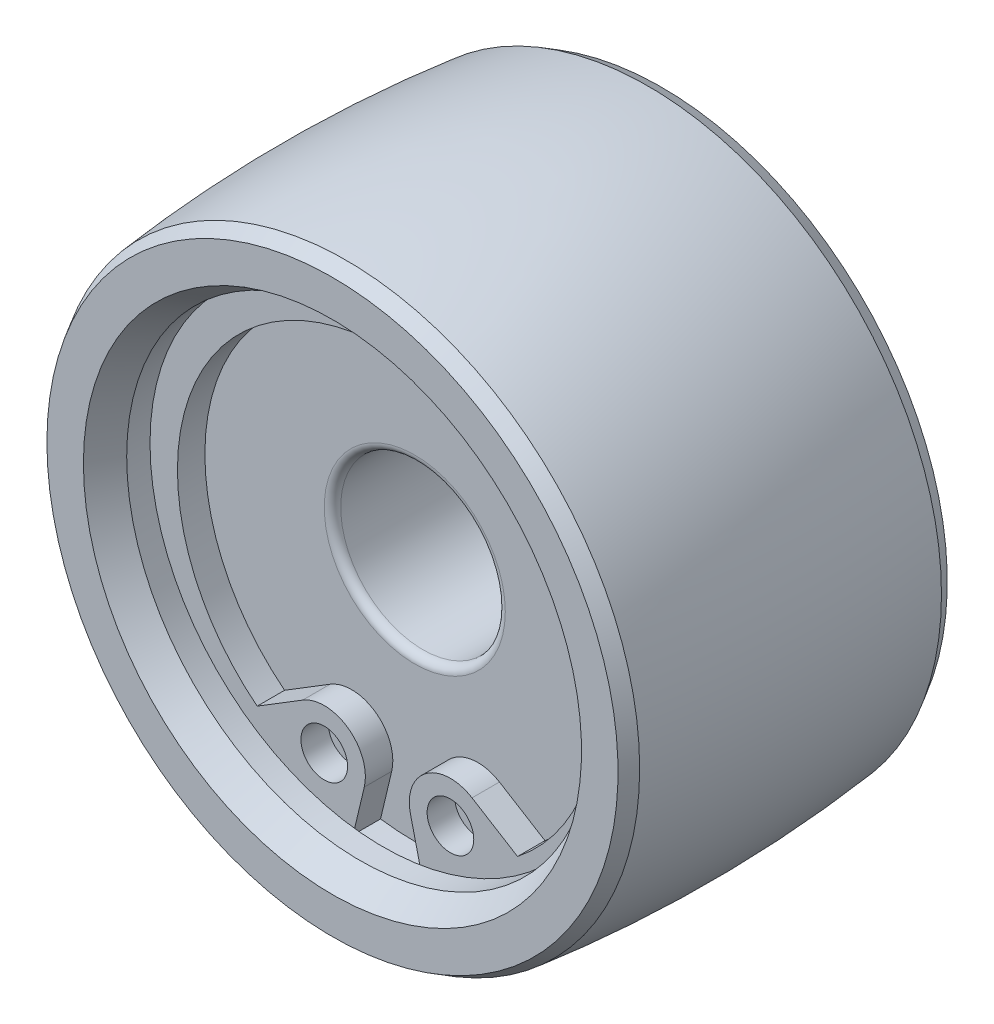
ISO-10303-21;
HEADER;
FILE_DESCRIPTION(('STEP AP214'),'2;1');
FILE_NAME('part.step','',(''),(''),'','','');
FILE_SCHEMA(('AUTOMOTIVE_DESIGN { 1 0 10303 214 1 1 1 1 }'));
ENDSEC;
DATA;
#1=APPLICATION_CONTEXT('core data for automotive mechanical design processes');
#2=APPLICATION_PROTOCOL_DEFINITION('international standard','automotive_design',2000,#1);
#3=PRODUCT_CONTEXT('',#1,'mechanical');
#4=PRODUCT('Part','Part','',(#3));
#5=PRODUCT_RELATED_PRODUCT_CATEGORY('part','',(#4));
#6=PRODUCT_DEFINITION_FORMATION('','',#4);
#7=PRODUCT_DEFINITION_CONTEXT('part definition',#1,'design');
#8=PRODUCT_DEFINITION('design','',#6,#7);
#9=PRODUCT_DEFINITION_SHAPE('','',#8);
#10=(LENGTH_UNIT() NAMED_UNIT(*) SI_UNIT(.MILLI.,.METRE.));
#11=(NAMED_UNIT(*) PLANE_ANGLE_UNIT() SI_UNIT($,.RADIAN.));
#12=(NAMED_UNIT(*) SI_UNIT($,.STERADIAN.) SOLID_ANGLE_UNIT());
#13=UNCERTAINTY_MEASURE_WITH_UNIT(LENGTH_MEASURE(1.E-05),#10,'distance_accuracy_value','');
#14=(GEOMETRIC_REPRESENTATION_CONTEXT(3) GLOBAL_UNCERTAINTY_ASSIGNED_CONTEXT((#13)) GLOBAL_UNIT_ASSIGNED_CONTEXT((#10,
#11,#12)) REPRESENTATION_CONTEXT('',''));
#15=CARTESIAN_POINT('',(0.,0.,0.));
#16=DIRECTION('',(0.,0.,1.));
#17=DIRECTION('',(1.,0.,0.));
#18=AXIS2_PLACEMENT_3D('',#15,#16,#17);
#19=CARTESIAN_POINT('',(0.,0.,-4.99999999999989));
#20=DIRECTION('',(0.,0.,1.));
#21=DIRECTION('',(1.,0.,0.));
#22=AXIS2_PLACEMENT_3D('',#19,#20,#21);
#23=CONICAL_SURFACE('',#22,10.9852544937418,0.523598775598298);
#24=CARTESIAN_POINT('',(0.,0.,-5.99999999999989));
#25=DIRECTION('',(0.,0.,-1.));
#26=DIRECTION('',(-1.,0.,0.));
#27=AXIS2_PLACEMENT_3D('',#24,#25,#26);
#28=CIRCLE('',#27,10.4079042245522);
#29=CARTESIAN_POINT('',(-10.4079042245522,0.,-5.99999999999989));
#30=VERTEX_POINT('',#29);
#31=EDGE_CURVE('E270',#30,#30,#28,.T.);
#32=ORIENTED_EDGE('',*,*,#31,.F.);
#33=EDGE_LOOP('',(#32));
#34=FACE_BOUND('',#33,.T.);
#35=CARTESIAN_POINT('',(0.,0.,-5.49999999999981));
#36=DIRECTION('',(0.,0.,-1.));
#37=DIRECTION('',(-1.,0.,0.));
#38=AXIS2_PLACEMENT_3D('',#35,#36,#37);
#39=CIRCLE('',#38,10.6965793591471);
#40=CARTESIAN_POINT('',(-10.6965793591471,0.,-5.49999999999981));
#41=VERTEX_POINT('',#40);
#42=EDGE_CURVE('E273',#41,#41,#39,.F.);
#43=ORIENTED_EDGE('',*,*,#42,.F.);
#44=EDGE_LOOP('',(#43));
#45=FACE_BOUND('',#44,.T.);
#46=ADVANCED_FACE('F14',(#34,#45),#23,.T.);
#47=CARTESIAN_POINT('',(0.,0.,-6.));
#48=DIRECTION('',(0.,0.,1.));
#49=DIRECTION('',(1.,0.,0.));
#50=AXIS2_PLACEMENT_3D('',#47,#48,#49);
#51=PLANE('',#50);
#52=ORIENTED_EDGE('',*,*,#31,.T.);
#53=EDGE_LOOP('',(#52));
#54=FACE_BOUND('',#53,.T.);
#55=CARTESIAN_POINT('',(0.,0.,-6.));
#56=DIRECTION('',(0.,0.,-1.));
#57=DIRECTION('',(-1.,0.,0.));
#58=AXIS2_PLACEMENT_3D('',#55,#56,#57);
#59=CIRCLE('',#58,6.5);
#60=CARTESIAN_POINT('',(-6.5,0.,-6.));
#61=VERTEX_POINT('',#60);
#62=EDGE_CURVE('E171',#61,#61,#59,.T.);
#63=ORIENTED_EDGE('',*,*,#62,.F.);
#64=EDGE_LOOP('',(#63));
#65=FACE_BOUND('',#64,.T.);
#66=ADVANCED_FACE('F307',(#54,#65),#51,.F.);
#67=CARTESIAN_POINT('',(0.,0.,0.));
#68=DIRECTION('',(0.,0.,-1.));
#69=DIRECTION('',(-1.,0.,0.));
#70=AXIS2_PLACEMENT_3D('',#67,#68,#69);
#71=DEGENERATE_TOROIDAL_SURFACE('',#70,39.,50.,.F.);
#72=ORIENTED_EDGE('',*,*,#42,.T.);
#73=EDGE_LOOP('',(#72));
#74=FACE_BOUND('',#73,.T.);
#75=CARTESIAN_POINT('',(0.,0.,5.5));
#76=DIRECTION('',(0.,0.,1.));
#77=DIRECTION('',(1.,0.,0.));
#78=AXIS2_PLACEMENT_3D('',#75,#76,#77);
#79=CIRCLE('',#78,10.6965793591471);
#80=CARTESIAN_POINT('',(10.6965793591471,0.,5.5));
#81=VERTEX_POINT('',#80);
#82=EDGE_CURVE('E277',#81,#81,#79,.F.);
#83=ORIENTED_EDGE('',*,*,#82,.T.);
#84=EDGE_LOOP('',(#83));
#85=FACE_BOUND('',#84,.T.);
#86=ADVANCED_FACE('F303',(#74,#85),#71,.F.);
#87=CARTESIAN_POINT('',(0.,0.,-275.));
#88=DIRECTION('',(0.,0.,-1.));
#89=DIRECTION('',(-1.,0.,0.));
#90=AXIS2_PLACEMENT_3D('',#87,#88,#89);
#91=CYLINDRICAL_SURFACE('',#90,6.5);
#92=CARTESIAN_POINT('',(0.,0.,-3.));
#93=DIRECTION('',(0.,0.,-1.));
#94=DIRECTION('',(-1.,0.,0.));
#95=AXIS2_PLACEMENT_3D('',#92,#93,#94);
#96=CIRCLE('',#95,6.5);
#97=CARTESIAN_POINT('',(-6.5,0.,-3.));
#98=VERTEX_POINT('',#97);
#99=EDGE_CURVE('E295',#98,#98,#96,.T.);
#100=ORIENTED_EDGE('',*,*,#99,.F.);
#101=EDGE_LOOP('',(#100));
#102=FACE_BOUND('',#101,.T.);
#103=ORIENTED_EDGE('',*,*,#62,.T.);
#104=EDGE_LOOP('',(#103));
#105=FACE_BOUND('',#104,.T.);
#106=ADVANCED_FACE('F362',(#102,#105),#91,.F.);
#107=CARTESIAN_POINT('',(0.,0.,6.));
#108=DIRECTION('',(0.,0.,-1.));
#109=DIRECTION('',(-1.,0.,0.));
#110=AXIS2_PLACEMENT_3D('',#107,#108,#109);
#111=CONICAL_SURFACE('',#110,10.4079042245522,0.523598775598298);
#112=CARTESIAN_POINT('',(0.,0.,6.));
#113=DIRECTION('',(0.,0.,-1.));
#114=DIRECTION('',(-1.,0.,0.));
#115=AXIS2_PLACEMENT_3D('',#112,#113,#114);
#116=CIRCLE('',#115,10.4079042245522);
#117=CARTESIAN_POINT('',(-10.4079042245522,0.,6.));
#118=VERTEX_POINT('',#117);
#119=EDGE_CURVE('E274',#118,#118,#116,.T.);
#120=ORIENTED_EDGE('',*,*,#119,.T.);
#121=EDGE_LOOP('',(#120));
#122=FACE_BOUND('',#121,.T.);
#123=ORIENTED_EDGE('',*,*,#82,.F.);
#124=EDGE_LOOP('',(#123));
#125=FACE_BOUND('',#124,.T.);
#126=ADVANCED_FACE('F330',(#122,#125),#111,.T.);
#127=CARTESIAN_POINT('',(0.,3.9383186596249,-3.));
#128=DIRECTION('',(0.,0.,-1.));
#129=DIRECTION('',(-1.,0.,0.));
#130=AXIS2_PLACEMENT_3D('',#127,#128,#129);
#131=PLANE('',#130);
#132=CARTESIAN_POINT('',(0.,0.,-3.));
#133=DIRECTION('',(0.,0.,1.));
#134=DIRECTION('',(1.,0.,0.));
#135=AXIS2_PLACEMENT_3D('',#132,#133,#134);
#136=CIRCLE('',#135,3.3);
#137=CARTESIAN_POINT('',(3.3,0.,-3.));
#138=VERTEX_POINT('',#137);
#139=EDGE_CURVE('E261',#138,#138,#136,.T.);
#140=ORIENTED_EDGE('',*,*,#139,.T.);
#141=EDGE_LOOP('',(#140));
#142=FACE_BOUND('',#141,.T.);
#143=ORIENTED_EDGE('',*,*,#99,.T.);
#144=EDGE_LOOP('',(#143));
#145=FACE_BOUND('',#144,.T.);
#146=ADVANCED_FACE('F326',(#142,#145),#131,.T.);
#147=CARTESIAN_POINT('',(0.,0.,6.));
#148=DIRECTION('',(0.,0.,1.));
#149=DIRECTION('',(1.,0.,0.));
#150=AXIS2_PLACEMENT_3D('',#147,#148,#149);
#151=PLANE('',#150);
#152=ORIENTED_EDGE('',*,*,#119,.F.);
#153=EDGE_LOOP('',(#152));
#154=FACE_BOUND('',#153,.T.);
#155=CARTESIAN_POINT('',(0.,0.,6.));
#156=DIRECTION('',(0.,0.,-1.));
#157=DIRECTION('',(-1.,0.,0.));
#158=AXIS2_PLACEMENT_3D('',#155,#156,#157);
#159=CIRCLE('',#158,9.07735026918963);
#160=CARTESIAN_POINT('',(-9.07735026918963,0.,6.));
#161=VERTEX_POINT('',#160);
#162=EDGE_CURVE('E280',#161,#161,#159,.T.);
#163=ORIENTED_EDGE('',*,*,#162,.T.);
#164=EDGE_LOOP('',(#163));
#165=FACE_BOUND('',#164,.T.);
#166=ADVANCED_FACE('F329',(#154,#165),#151,.T.);
#167=CARTESIAN_POINT('',(0.,0.,-2.70000000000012));
#168=DIRECTION('',(0.,0.,1.));
#169=DIRECTION('',(1.,0.,0.));
#170=AXIS2_PLACEMENT_3D('',#167,#168,#169);
#171=TOROIDAL_SURFACE('',#170,3.29999999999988,0.299999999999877);
#172=ORIENTED_EDGE('',*,*,#139,.F.);
#173=EDGE_LOOP('',(#172));
#174=FACE_BOUND('',#173,.T.);
#175=CARTESIAN_POINT('',(0.,0.,-2.7));
#176=DIRECTION('',(0.,0.,1.));
#177=DIRECTION('',(1.,0.,0.));
#178=AXIS2_PLACEMENT_3D('',#175,#176,#177);
#179=CIRCLE('',#178,3.);
#180=CARTESIAN_POINT('',(3.,0.,-2.7));
#181=VERTEX_POINT('',#180);
#182=EDGE_CURVE('E264',#181,#181,#179,.T.);
#183=ORIENTED_EDGE('',*,*,#182,.T.);
#184=EDGE_LOOP('',(#183));
#185=FACE_BOUND('',#184,.T.);
#186=ADVANCED_FACE('F332',(#174,#185),#171,.T.);
#187=CARTESIAN_POINT('',(0.,0.,5.));
#188=DIRECTION('',(0.,0.,1.));
#189=DIRECTION('',(1.,0.,0.));
#190=AXIS2_PLACEMENT_3D('',#187,#188,#189);
#191=CONICAL_SURFACE('',#190,8.5,0.523598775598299);
#192=ORIENTED_EDGE('',*,*,#162,.F.);
#193=EDGE_LOOP('',(#192));
#194=FACE_BOUND('',#193,.T.);
#195=CARTESIAN_POINT('',(0.,0.,5.));
#196=DIRECTION('',(0.,0.,-1.));
#197=DIRECTION('',(-1.,0.,0.));
#198=AXIS2_PLACEMENT_3D('',#195,#196,#197);
#199=CIRCLE('',#198,8.5);
#200=CARTESIAN_POINT('',(-8.5,0.,5.));
#201=VERTEX_POINT('',#200);
#202=EDGE_CURVE('E283',#201,#201,#199,.T.);
#203=ORIENTED_EDGE('',*,*,#202,.T.);
#204=EDGE_LOOP('',(#203));
#205=FACE_BOUND('',#204,.T.);
#206=ADVANCED_FACE('F335',(#194,#205),#191,.F.);
#207=CARTESIAN_POINT('',(0.,0.,-47.));
#208=DIRECTION('',(0.,0.,1.));
#209=DIRECTION('',(1.,0.,0.));
#210=AXIS2_PLACEMENT_3D('',#207,#208,#209);
#211=CYLINDRICAL_SURFACE('',#210,3.);
#212=ORIENTED_EDGE('',*,*,#182,.F.);
#213=EDGE_LOOP('',(#212));
#214=FACE_BOUND('',#213,.T.);
#215=CARTESIAN_POINT('',(0.,0.,2.7));
#216=DIRECTION('',(0.,0.,1.));
#217=DIRECTION('',(1.,0.,0.));
#218=AXIS2_PLACEMENT_3D('',#215,#216,#217);
#219=CIRCLE('',#218,3.);
#220=CARTESIAN_POINT('',(3.,0.,2.7));
#221=VERTEX_POINT('',#220);
#222=EDGE_CURVE('E267',#221,#221,#219,.T.);
#223=ORIENTED_EDGE('',*,*,#222,.T.);
#224=EDGE_LOOP('',(#223));
#225=FACE_BOUND('',#224,.T.);
#226=ADVANCED_FACE('F337',(#214,#225),#211,.F.);
#227=CARTESIAN_POINT('',(0.,0.,-275.));
#228=DIRECTION('',(0.,0.,-1.));
#229=DIRECTION('',(-1.,0.,0.));
#230=AXIS2_PLACEMENT_3D('',#227,#228,#229);
#231=CYLINDRICAL_SURFACE('',#230,8.5);
#232=ORIENTED_EDGE('',*,*,#202,.F.);
#233=EDGE_LOOP('',(#232));
#234=FACE_BOUND('',#233,.T.);
#235=CARTESIAN_POINT('',(0.,0.,4.15));
#236=DIRECTION('',(0.,0.,-1.));
#237=DIRECTION('',(-1.,0.,0.));
#238=AXIS2_PLACEMENT_3D('',#235,#236,#237);
#239=CIRCLE('',#238,8.5);
#240=CARTESIAN_POINT('',(-8.5,0.,4.15));
#241=VERTEX_POINT('',#240);
#242=EDGE_CURVE('E286',#241,#241,#239,.T.);
#243=ORIENTED_EDGE('',*,*,#242,.T.);
#244=EDGE_LOOP('',(#243));
#245=FACE_BOUND('',#244,.T.);
#246=ADVANCED_FACE('F339',(#234,#245),#231,.F.);
#247=CARTESIAN_POINT('',(0.,0.,2.7));
#248=DIRECTION('',(0.,0.,1.));
#249=DIRECTION('',(1.,0.,0.));
#250=AXIS2_PLACEMENT_3D('',#247,#248,#249);
#251=TOROIDAL_SURFACE('',#250,3.29999999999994,0.299999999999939);
#252=ORIENTED_EDGE('',*,*,#222,.F.);
#253=EDGE_LOOP('',(#252));
#254=FACE_BOUND('',#253,.T.);
#255=CARTESIAN_POINT('',(0.,0.,3.));
#256=DIRECTION('',(0.,0.,1.));
#257=DIRECTION('',(1.,0.,0.));
#258=AXIS2_PLACEMENT_3D('',#255,#256,#257);
#259=CIRCLE('',#258,3.3);
#260=CARTESIAN_POINT('',(3.3,0.,3.));
#261=VERTEX_POINT('',#260);
#262=EDGE_CURVE('E258',#261,#261,#259,.T.);
#263=ORIENTED_EDGE('',*,*,#262,.T.);
#264=EDGE_LOOP('',(#263));
#265=FACE_BOUND('',#264,.T.);
#266=ADVANCED_FACE('F324',(#254,#265),#251,.T.);
#267=CARTESIAN_POINT('',(0.,9.8354869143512,3.));
#268=DIRECTION('',(0.,0.,1.));
#269=DIRECTION('',(1.,0.,0.));
#270=AXIS2_PLACEMENT_3D('',#267,#268,#269);
#271=PLANE('',#270);
#272=ORIENTED_EDGE('',*,*,#262,.F.);
#273=EDGE_LOOP('',(#272));
#274=FACE_BOUND('',#273,.T.);
#275=CARTESIAN_POINT('',(0.,0.,3.));
#276=DIRECTION('',(0.,0.,-1.));
#277=DIRECTION('',(-1.,0.,0.));
#278=AXIS2_PLACEMENT_3D('',#275,#276,#277);
#279=CIRCLE('',#278,8.9);
#280=CARTESIAN_POINT('',(1.24703201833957,-8.81220240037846,3.));
#281=VERTEX_POINT('',#280);
#282=CARTESIAN_POINT('',(-1.24703201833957,-8.81220240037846,3.));
#283=VERTEX_POINT('',#282);
#284=EDGE_CURVE('E292',#281,#283,#279,.T.);
#285=ORIENTED_EDGE('',*,*,#284,.F.);
#286=DIRECTION('',(-0.231349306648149,0.972870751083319,0.));
#287=VECTOR('',#286,1.);
#288=CARTESIAN_POINT('',(-3.01680314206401,9.11808913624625,3.));
#289=LINE('',#288,#287);
#290=CARTESIAN_POINT('',(0.840693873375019,-7.10346809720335,3.));
#291=VERTEX_POINT('',#290);
#292=EDGE_CURVE('E9',#281,#291,#289,.T.);
#293=ORIENTED_EDGE('',*,*,#292,.T.);
#294=CARTESIAN_POINT('',(2.3,-6.75644413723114,3.));
#295=DIRECTION('',(0.,0.,1.));
#296=DIRECTION('',(1.,0.,0.));
#297=AXIS2_PLACEMENT_3D('',#294,#295,#296);
#298=CIRCLE('',#297,1.5);
#299=CARTESIAN_POINT('',(3.08650226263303,-5.47917588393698,3.));
#300=VERTEX_POINT('',#299);
#301=EDGE_CURVE('E25',#300,#291,#298,.T.);
#302=ORIENTED_EDGE('',*,*,#301,.F.);
#303=DIRECTION('',(0.851512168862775,-0.524334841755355,0.));
#304=VECTOR('',#303,1.);
#305=CARTESIAN_POINT('',(-5.98908944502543,0.109292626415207,3.));
#306=LINE('',#305,#304);
#307=CARTESIAN_POINT('',(4.745138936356,-6.50051301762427,3.));
#308=VERTEX_POINT('',#307);
#309=EDGE_CURVE('E102',#300,#308,#306,.T.);
#310=ORIENTED_EDGE('',*,*,#309,.T.);
#311=CARTESIAN_POINT('',(0.,-0.5,3.));
#312=DIRECTION('',(0.,0.,1.));
#313=DIRECTION('',(1.,0.,0.));
#314=AXIS2_PLACEMENT_3D('',#311,#312,#313);
#315=CIRCLE('',#314,7.65);
#316=CARTESIAN_POINT('',(-4.74513893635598,-6.50051301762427,3.));
#317=VERTEX_POINT('',#316);
#318=EDGE_CURVE('E106',#308,#317,#315,.T.);
#319=ORIENTED_EDGE('',*,*,#318,.T.);
#320=DIRECTION('',(0.851512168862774,0.524334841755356,0.));
#321=VECTOR('',#320,1.);
#322=CARTESIAN_POINT('',(5.98908944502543,0.109292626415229,3.));
#323=LINE('',#322,#321);
#324=CARTESIAN_POINT('',(-3.08650226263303,-5.47917588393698,3.));
#325=VERTEX_POINT('',#324);
#326=EDGE_CURVE('E121',#317,#325,#323,.T.);
#327=ORIENTED_EDGE('',*,*,#326,.T.);
#328=CARTESIAN_POINT('',(-2.3,-6.75644413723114,3.));
#329=DIRECTION('',(0.,0.,1.));
#330=DIRECTION('',(1.,0.,0.));
#331=AXIS2_PLACEMENT_3D('',#328,#329,#330);
#332=CIRCLE('',#331,1.5);
#333=CARTESIAN_POINT('',(-0.840693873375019,-7.10346809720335,3.));
#334=VERTEX_POINT('',#333);
#335=EDGE_CURVE('E233',#334,#325,#332,.T.);
#336=ORIENTED_EDGE('',*,*,#335,.F.);
#337=DIRECTION('',(-0.231349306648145,-0.97287075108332,0.));
#338=VECTOR('',#337,1.);
#339=CARTESIAN_POINT('',(3.01680314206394,9.11808913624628,3.));
#340=LINE('',#339,#338);
#341=EDGE_CURVE('E230',#334,#283,#340,.T.);
#342=ORIENTED_EDGE('',*,*,#341,.T.);
#343=EDGE_LOOP('',(#285,#293,#302,#310,#319,#327,#336,#342));
#344=FACE_BOUND('',#343,.T.);
#345=ADVANCED_FACE('F105',(#274,#344),#271,.T.);
#346=CARTESIAN_POINT('',(0.,8.5,4.15));
#347=DIRECTION('',(0.,0.,1.));
#348=DIRECTION('',(1.,0.,0.));
#349=AXIS2_PLACEMENT_3D('',#346,#347,#348);
#350=PLANE('',#349);
#351=ORIENTED_EDGE('',*,*,#242,.F.);
#352=EDGE_LOOP('',(#351));
#353=FACE_BOUND('',#352,.T.);
#354=CARTESIAN_POINT('',(0.,0.,4.15));
#355=DIRECTION('',(0.,0.,-1.));
#356=DIRECTION('',(-1.,0.,0.));
#357=AXIS2_PLACEMENT_3D('',#354,#355,#356);
#358=CIRCLE('',#357,8.9);
#359=CARTESIAN_POINT('',(-8.9,0.,4.15));
#360=VERTEX_POINT('',#359);
#361=EDGE_CURVE('E289',#360,#360,#358,.T.);
#362=ORIENTED_EDGE('',*,*,#361,.T.);
#363=EDGE_LOOP('',(#362));
#364=FACE_BOUND('',#363,.T.);
#365=ADVANCED_FACE('F323',(#353,#364),#350,.F.);
#366=CARTESIAN_POINT('',(0.,0.,-275.));
#367=DIRECTION('',(0.,0.,-1.));
#368=DIRECTION('',(-1.,0.,0.));
#369=AXIS2_PLACEMENT_3D('',#366,#367,#368);
#370=CYLINDRICAL_SURFACE('',#369,8.9);
#371=ORIENTED_EDGE('',*,*,#361,.F.);
#372=EDGE_LOOP('',(#371));
#373=FACE_BOUND('',#372,.T.);
#374=DIRECTION('',(0.,0.,-1.));
#375=VECTOR('',#374,1.);
#376=CARTESIAN_POINT('',(1.24703201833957,-8.81220240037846,-275.));
#377=LINE('',#376,#375);
#378=CARTESIAN_POINT('',(1.24703201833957,-8.81220240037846,4.));
#379=VERTEX_POINT('',#378);
#380=EDGE_CURVE('E251',#281,#379,#377,.F.);
#381=ORIENTED_EDGE('',*,*,#380,.F.);
#382=ORIENTED_EDGE('',*,*,#284,.T.);
#383=DIRECTION('',(0.,0.,-1.));
#384=VECTOR('',#383,1.);
#385=CARTESIAN_POINT('',(-1.24703201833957,-8.81220240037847,-275.));
#386=LINE('',#385,#384);
#387=CARTESIAN_POINT('',(-1.24703201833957,-8.81220240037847,4.));
#388=VERTEX_POINT('',#387);
#389=EDGE_CURVE('E255',#388,#283,#386,.T.);
#390=ORIENTED_EDGE('',*,*,#389,.F.);
#391=CARTESIAN_POINT('',(0.,0.,4.));
#392=DIRECTION('',(0.,0.,-1.));
#393=DIRECTION('',(-1.,0.,0.));
#394=AXIS2_PLACEMENT_3D('',#391,#392,#393);
#395=CIRCLE('',#394,8.9);
#396=EDGE_CURVE('E253',#379,#388,#395,.F.);
#397=ORIENTED_EDGE('',*,*,#396,.F.);
#398=EDGE_LOOP('',(#381,#382,#390,#397));
#399=FACE_BOUND('',#398,.T.);
#400=ADVANCED_FACE('F377',(#373,#399),#370,.F.);
#401=CARTESIAN_POINT('',(2.3,-6.75644413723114,3.));
#402=DIRECTION('',(0.,0.,1.));
#403=DIRECTION('',(1.,0.,0.));
#404=AXIS2_PLACEMENT_3D('',#401,#402,#403);
#405=CIRCLE('',#404,0.85);
#406=CARTESIAN_POINT('',(3.15,-6.75644413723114,3.));
#407=VERTEX_POINT('',#406);
#408=EDGE_CURVE('E247',#407,#407,#405,.T.);
#409=ORIENTED_EDGE('',*,*,#408,.T.);
#410=EDGE_LOOP('',(#409));
#411=FACE_BOUND('',#410,.T.);
#412=ADVANCED_FACE('F211',(#411),#271,.T.);
#413=CARTESIAN_POINT('',(-2.3,-6.75644413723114,3.));
#414=DIRECTION('',(0.,0.,1.));
#415=DIRECTION('',(1.,0.,0.));
#416=AXIS2_PLACEMENT_3D('',#413,#414,#415);
#417=CIRCLE('',#416,0.85);
#418=CARTESIAN_POINT('',(-1.45,-6.75644413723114,3.));
#419=VERTEX_POINT('',#418);
#420=EDGE_CURVE('E243',#419,#419,#417,.T.);
#421=ORIENTED_EDGE('',*,*,#420,.T.);
#422=EDGE_LOOP('',(#421));
#423=FACE_BOUND('',#422,.T.);
#424=ADVANCED_FACE('F204',(#423),#271,.T.);
#425=CARTESIAN_POINT('',(3.08650226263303,-5.47917588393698,4.));
#426=DIRECTION('',(-0.524334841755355,-0.851512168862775,0.));
#427=DIRECTION('',(-0.851512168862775,0.524334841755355,0.));
#428=AXIS2_PLACEMENT_3D('',#425,#426,#427);
#429=PLANE('',#428);
#430=ORIENTED_EDGE('',*,*,#309,.F.);
#431=DIRECTION('',(0.,0.,-1.));
#432=VECTOR('',#431,1.);
#433=CARTESIAN_POINT('',(3.08650226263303,-5.47917588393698,4.));
#434=LINE('',#433,#432);
#435=CARTESIAN_POINT('',(3.08650226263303,-5.47917588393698,4.));
#436=VERTEX_POINT('',#435);
#437=EDGE_CURVE('E142',#436,#300,#434,.T.);
#438=ORIENTED_EDGE('',*,*,#437,.F.);
#439=DIRECTION('',(-0.851512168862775,0.524334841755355,0.));
#440=VECTOR('',#439,1.);
#441=CARTESIAN_POINT('',(3.08650226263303,-5.47917588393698,4.));
#442=LINE('',#441,#440);
#443=CARTESIAN_POINT('',(4.74513893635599,-6.50051301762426,4.));
#444=VERTEX_POINT('',#443);
#445=EDGE_CURVE('E125',#444,#436,#442,.T.);
#446=ORIENTED_EDGE('',*,*,#445,.F.);
#447=DIRECTION('',(0.,0.,-1.));
#448=VECTOR('',#447,1.);
#449=CARTESIAN_POINT('',(4.74513893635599,-6.50051301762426,4.));
#450=LINE('',#449,#448);
#451=EDGE_CURVE('E117',#444,#308,#450,.T.);
#452=ORIENTED_EDGE('',*,*,#451,.T.);
#453=EDGE_LOOP('',(#430,#438,#446,#452));
#454=FACE_BOUND('',#453,.T.);
#455=ADVANCED_FACE('F123',(#454),#429,.F.);
#456=CARTESIAN_POINT('',(0.,-0.5,4.));
#457=DIRECTION('',(0.,0.,1.));
#458=DIRECTION('',(-1.,0.,0.));
#459=AXIS2_PLACEMENT_3D('',#456,#457,#458);
#460=CYLINDRICAL_SURFACE('',#459,7.65);
#461=ORIENTED_EDGE('',*,*,#318,.F.);
#462=ORIENTED_EDGE('',*,*,#451,.F.);
#463=CARTESIAN_POINT('',(0.,-0.5,4.));
#464=DIRECTION('',(0.,0.,-1.));
#465=DIRECTION('',(0.,-1.,0.));
#466=AXIS2_PLACEMENT_3D('',#463,#464,#465);
#467=CIRCLE('',#466,7.65);
#468=CARTESIAN_POINT('',(-4.74513893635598,-6.50051301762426,4.));
#469=VERTEX_POINT('',#468);
#470=EDGE_CURVE('E133',#469,#444,#467,.T.);
#471=ORIENTED_EDGE('',*,*,#470,.F.);
#472=DIRECTION('',(0.,0.,-1.));
#473=VECTOR('',#472,1.);
#474=CARTESIAN_POINT('',(-4.74513893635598,-6.50051301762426,4.));
#475=LINE('',#474,#473);
#476=EDGE_CURVE('E119',#469,#317,#475,.T.);
#477=ORIENTED_EDGE('',*,*,#476,.T.);
#478=EDGE_LOOP('',(#461,#462,#471,#477));
#479=FACE_BOUND('',#478,.T.);
#480=ADVANCED_FACE('F115',(#479),#460,.F.);
#481=CARTESIAN_POINT('',(-3.08650226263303,-5.47917588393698,4.));
#482=DIRECTION('',(0.524334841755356,-0.851512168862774,0.));
#483=DIRECTION('',(0.,0.,-1.));
#484=AXIS2_PLACEMENT_3D('',#481,#482,#483);
#485=PLANE('',#484);
#486=ORIENTED_EDGE('',*,*,#326,.F.);
#487=ORIENTED_EDGE('',*,*,#476,.F.);
#488=DIRECTION('',(-0.851512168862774,-0.524334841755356,0.));
#489=VECTOR('',#488,1.);
#490=CARTESIAN_POINT('',(-3.08650226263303,-5.47917588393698,4.));
#491=LINE('',#490,#489);
#492=CARTESIAN_POINT('',(-3.08650226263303,-5.47917588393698,4.));
#493=VERTEX_POINT('',#492);
#494=EDGE_CURVE('E66',#493,#469,#491,.T.);
#495=ORIENTED_EDGE('',*,*,#494,.F.);
#496=DIRECTION('',(0.,0.,-1.));
#497=VECTOR('',#496,1.);
#498=CARTESIAN_POINT('',(-3.08650226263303,-5.47917588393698,4.));
#499=LINE('',#498,#497);
#500=EDGE_CURVE('E131',#493,#325,#499,.T.);
#501=ORIENTED_EDGE('',*,*,#500,.T.);
#502=EDGE_LOOP('',(#486,#487,#495,#501));
#503=FACE_BOUND('',#502,.T.);
#504=ADVANCED_FACE('F210',(#503),#485,.F.);
#505=CARTESIAN_POINT('',(2.3,-6.75644413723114,4.));
#506=DIRECTION('',(0.,0.,1.));
#507=DIRECTION('',(-1.,0.,0.));
#508=AXIS2_PLACEMENT_3D('',#505,#506,#507);
#509=CYLINDRICAL_SURFACE('',#508,0.85);
#510=ORIENTED_EDGE('',*,*,#408,.F.);
#511=EDGE_LOOP('',(#510));
#512=FACE_BOUND('',#511,.T.);
#513=CARTESIAN_POINT('',(2.3,-6.75644413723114,4.));
#514=DIRECTION('',(0.,0.,1.));
#515=DIRECTION('',(1.,0.,0.));
#516=AXIS2_PLACEMENT_3D('',#513,#514,#515);
#517=CIRCLE('',#516,0.85);
#518=CARTESIAN_POINT('',(3.15,-6.75644413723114,4.));
#519=VERTEX_POINT('',#518);
#520=EDGE_CURVE('E164',#519,#519,#517,.T.);
#521=ORIENTED_EDGE('',*,*,#520,.T.);
#522=EDGE_LOOP('',(#521));
#523=FACE_BOUND('',#522,.T.);
#524=ADVANCED_FACE('F216',(#512,#523),#509,.F.);
#525=CARTESIAN_POINT('',(-2.3,-6.75644413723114,4.));
#526=DIRECTION('',(0.,0.,1.));
#527=DIRECTION('',(-1.,0.,0.));
#528=AXIS2_PLACEMENT_3D('',#525,#526,#527);
#529=CYLINDRICAL_SURFACE('',#528,0.85);
#530=ORIENTED_EDGE('',*,*,#420,.F.);
#531=EDGE_LOOP('',(#530));
#532=FACE_BOUND('',#531,.T.);
#533=CARTESIAN_POINT('',(-2.3,-6.75644413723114,4.));
#534=DIRECTION('',(0.,0.,-1.));
#535=DIRECTION('',(1.,0.,0.));
#536=AXIS2_PLACEMENT_3D('',#533,#534,#535);
#537=CIRCLE('',#536,0.85);
#538=CARTESIAN_POINT('',(-1.45,-6.75644413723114,4.));
#539=VERTEX_POINT('',#538);
#540=EDGE_CURVE('E144',#539,#539,#537,.T.);
#541=ORIENTED_EDGE('',*,*,#540,.F.);
#542=EDGE_LOOP('',(#541));
#543=FACE_BOUND('',#542,.T.);
#544=ADVANCED_FACE('F218',(#532,#543),#529,.F.);
#545=CARTESIAN_POINT('',(2.3,-6.75644413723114,4.));
#546=DIRECTION('',(0.,0.,1.));
#547=DIRECTION('',(-1.,0.,0.));
#548=AXIS2_PLACEMENT_3D('',#545,#546,#547);
#549=CYLINDRICAL_SURFACE('',#548,1.5);
#550=ORIENTED_EDGE('',*,*,#301,.T.);
#551=DIRECTION('',(0.,0.,-1.));
#552=VECTOR('',#551,1.);
#553=CARTESIAN_POINT('',(0.840693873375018,-7.10346809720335,4.));
#554=LINE('',#553,#552);
#555=CARTESIAN_POINT('',(0.840693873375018,-7.10346809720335,4.));
#556=VERTEX_POINT('',#555);
#557=EDGE_CURVE('E145',#556,#291,#554,.T.);
#558=ORIENTED_EDGE('',*,*,#557,.F.);
#559=CARTESIAN_POINT('',(2.3,-6.75644413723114,4.));
#560=DIRECTION('',(0.,0.,1.));
#561=DIRECTION('',(1.,0.,0.));
#562=AXIS2_PLACEMENT_3D('',#559,#560,#561);
#563=CIRCLE('',#562,1.5);
#564=EDGE_CURVE('E138',#436,#556,#563,.T.);
#565=ORIENTED_EDGE('',*,*,#564,.F.);
#566=ORIENTED_EDGE('',*,*,#437,.T.);
#567=EDGE_LOOP('',(#550,#558,#565,#566));
#568=FACE_BOUND('',#567,.T.);
#569=ADVANCED_FACE('F16',(#568),#549,.T.);
#570=CARTESIAN_POINT('',(-2.3,-6.75644413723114,4.));
#571=DIRECTION('',(0.,0.,1.));
#572=DIRECTION('',(-1.,0.,0.));
#573=AXIS2_PLACEMENT_3D('',#570,#571,#572);
#574=CYLINDRICAL_SURFACE('',#573,1.5);
#575=ORIENTED_EDGE('',*,*,#335,.T.);
#576=ORIENTED_EDGE('',*,*,#500,.F.);
#577=CARTESIAN_POINT('',(-2.3,-6.75644413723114,4.));
#578=DIRECTION('',(0.,0.,1.));
#579=DIRECTION('',(-1.,0.,0.));
#580=AXIS2_PLACEMENT_3D('',#577,#578,#579);
#581=CIRCLE('',#580,1.5);
#582=CARTESIAN_POINT('',(-0.84069387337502,-7.10346809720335,4.));
#583=VERTEX_POINT('',#582);
#584=EDGE_CURVE('E137',#583,#493,#581,.T.);
#585=ORIENTED_EDGE('',*,*,#584,.F.);
#586=DIRECTION('',(0.,0.,-1.));
#587=VECTOR('',#586,1.);
#588=CARTESIAN_POINT('',(-0.84069387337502,-7.10346809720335,4.));
#589=LINE('',#588,#587);
#590=EDGE_CURVE('E167',#583,#334,#589,.T.);
#591=ORIENTED_EDGE('',*,*,#590,.T.);
#592=EDGE_LOOP('',(#575,#576,#585,#591));
#593=FACE_BOUND('',#592,.T.);
#594=ADVANCED_FACE('F191',(#593),#574,.T.);
#595=CARTESIAN_POINT('',(0.,-0.5,4.));
#596=DIRECTION('',(0.,0.,-1.));
#597=DIRECTION('',(0.,-1.,0.));
#598=AXIS2_PLACEMENT_3D('',#595,#596,#597);
#599=PLANE('',#598);
#600=ORIENTED_EDGE('',*,*,#540,.T.);
#601=EDGE_LOOP('',(#600));
#602=FACE_BOUND('',#601,.T.);
#603=ORIENTED_EDGE('',*,*,#520,.F.);
#604=EDGE_LOOP('',(#603));
#605=FACE_BOUND('',#604,.T.);
#606=DIRECTION('',(0.231349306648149,-0.972870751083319,0.));
#607=VECTOR('',#606,1.);
#608=CARTESIAN_POINT('',(0.840693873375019,-7.10346809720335,4.));
#609=LINE('',#608,#607);
#610=EDGE_CURVE('E18',#556,#379,#609,.T.);
#611=ORIENTED_EDGE('',*,*,#610,.T.);
#612=ORIENTED_EDGE('',*,*,#396,.T.);
#613=DIRECTION('',(0.231349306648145,0.97287075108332,0.));
#614=VECTOR('',#613,1.);
#615=CARTESIAN_POINT('',(-0.84069387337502,-7.10346809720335,4.));
#616=LINE('',#615,#614);
#617=EDGE_CURVE('E146',#388,#583,#616,.T.);
#618=ORIENTED_EDGE('',*,*,#617,.T.);
#619=ORIENTED_EDGE('',*,*,#584,.T.);
#620=ORIENTED_EDGE('',*,*,#494,.T.);
#621=ORIENTED_EDGE('',*,*,#470,.T.);
#622=ORIENTED_EDGE('',*,*,#445,.T.);
#623=ORIENTED_EDGE('',*,*,#564,.T.);
#624=EDGE_LOOP('',(#611,#612,#618,#619,#620,#621,#622,#623));
#625=FACE_BOUND('',#624,.T.);
#626=ADVANCED_FACE('F188',(#602,#605,#625),#599,.F.);
#627=CARTESIAN_POINT('',(-0.84069387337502,-7.10346809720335,4.));
#628=DIRECTION('',(-0.97287075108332,0.231349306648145,0.));
#629=DIRECTION('',(0.,0.,1.));
#630=AXIS2_PLACEMENT_3D('',#627,#628,#629);
#631=PLANE('',#630);
#632=ORIENTED_EDGE('',*,*,#617,.F.);
#633=ORIENTED_EDGE('',*,*,#389,.T.);
#634=ORIENTED_EDGE('',*,*,#341,.F.);
#635=ORIENTED_EDGE('',*,*,#590,.F.);
#636=EDGE_LOOP('',(#632,#633,#634,#635));
#637=FACE_BOUND('',#636,.T.);
#638=ADVANCED_FACE('F190',(#637),#631,.F.);
#639=CARTESIAN_POINT('',(0.840693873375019,-7.10346809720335,4.));
#640=DIRECTION('',(0.972870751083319,0.231349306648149,0.));
#641=DIRECTION('',(0.,0.,-1.));
#642=AXIS2_PLACEMENT_3D('',#639,#640,#641);
#643=PLANE('',#642);
#644=ORIENTED_EDGE('',*,*,#292,.F.);
#645=ORIENTED_EDGE('',*,*,#380,.T.);
#646=ORIENTED_EDGE('',*,*,#610,.F.);
#647=ORIENTED_EDGE('',*,*,#557,.T.);
#648=EDGE_LOOP('',(#644,#645,#646,#647));
#649=FACE_BOUND('',#648,.T.);
#650=ADVANCED_FACE('F197',(#649),#643,.F.);
#651=CLOSED_SHELL('',(#46,#66,#86,#106,#126,#146,#166,#186,#206,#226,#246,#266,#345,#365,#400,
#412,#424,#455,#480,#504,#524,#544,#569,#594,#626,#638,#650));
#652=MANIFOLD_SOLID_BREP('B1',#651);
#653=ADVANCED_BREP_SHAPE_REPRESENTATION('',(#18,#652),#14);
#654=SHAPE_DEFINITION_REPRESENTATION(#9,#653);
ENDSEC;
END-ISO-10303-21;
